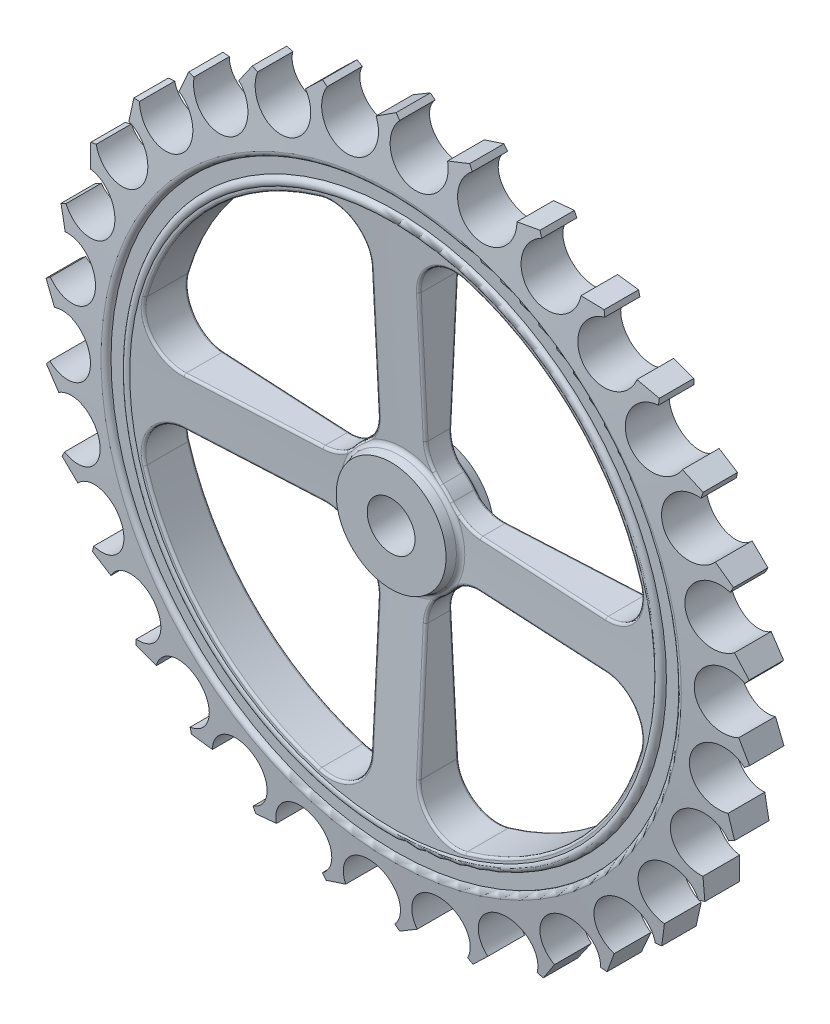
from build123d import *

# Parameters (mm, degrees)
CUT_EXTRUDE_1_DEPTH = 5
FILLET_1_R          = 0.5
SKETCH_5_OUTSIDE_W  = 191.882
SKETCH_5_OUTSIDE_H  = 191.882
CUT_EXTRUDE_2_DEPTH = 5


with BuildPart() as part:
    # Sketch 3 → Revolve 1 (revolve)
    with BuildSketch(Plane(origin=(0, 0, 0), x_dir=(0, 0, -1), z_dir=(1, 0, 0)), mode=Mode.PRIVATE) as revolve_1_sk:
        with BuildLine():
            Line((5, 5), (-5, 5))
            Line((-5, 5), (-5, 11.5))
            Line((-5, 11.5), (-3.289756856, 11.958258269))
            ThreePointArc((-3.289756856, 11.958258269), (-2.739558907, 12.336398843), (-2.549946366, 12.976520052))
            Line((-2.549946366, 12.976520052), (-4.75, 54.956044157))
            ThreePointArc((-4.75, 54.956044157), (-4.911437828, 56.028919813), (-4, 56.617481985))
            Line((-4, 56.617481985), (-4, 59.617481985))
            ThreePointArc((-4, 59.617481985), (-4.743144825, 59.948351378), (-4.994521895, 60.722010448))
            Line((-4.994521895, 60.722010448), (-3.6, 73.99))
            Line((-3.6, 73.99), (3.6, 73.99))
            Line((3.6, 73.99), (4.994521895, 60.722010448))
            ThreePointArc((4.994521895, 60.722010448), (4.743144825, 59.948351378), (4, 59.617481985))
            Line((4, 59.617481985), (4, 56.617481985))
            ThreePointArc((4, 56.617481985), (4.911437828, 56.028919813), (4.75, 54.956044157))
            Line((4.75, 54.956044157), (2.549946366, 12.976520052))
            ThreePointArc((2.549946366, 12.976520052), (2.739558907, 12.336398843), (3.289756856, 11.958258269))
            Line((3.289756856, 11.958258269), (5, 11.5))
            Line((5, 11.5), (5, 5))
        make_face()
    revolve(revolve_1_sk.sketch.rotate(Axis((0, 0, 28.336649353), (0, 0, -1)), 90), axis=Axis((0, 0, 28.336649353), (0, 0, -1)))

    # Sketch 4 → Cut-Extrude 1 (cut, symmetric)
    with BuildSketch(Plane.XY):
        with BuildLine():
            Line((5, 44.124822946), (5, 16.492422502))
            ThreePointArc((5, 16.492422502), (5.802116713, 13.000936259), (8.047619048, 10.209594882))
            ThreePointArc((8.047619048, 10.209594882), (9.192388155, 9.192388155), (10.209594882, 8.047619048))
            ThreePointArc((10.209594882, 8.047619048), (13.000936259, 5.802116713), (16.492422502, 5))
            Line((16.492422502, 5), (44.124822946, 5))
            ThreePointArc((44.124822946, 5), (50.531341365, 8.208703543), (51.798705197, 15.260869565))
            ThreePointArc((51.798705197, 15.260869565), (38.183766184, 38.183766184), (15.260869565, 51.798705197))
            ThreePointArc((15.260869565, 51.798705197), (8.208703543, 50.531341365), (5, 44.124822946))
        make_face()
        with BuildLine():
            Line((44.124822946, -5), (16.492422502, -5))
            ThreePointArc((16.492422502, -5), (13.000936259, -5.802116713), (10.209594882, -8.047619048))
            ThreePointArc((10.209594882, -8.047619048), (9.192388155, -9.192388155), (8.047619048, -10.209594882))
            ThreePointArc((8.047619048, -10.209594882), (5.802116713, -13.000936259), (5, -16.492422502))
            Line((5, -16.492422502), (5, -44.124822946))
            ThreePointArc((5, -44.124822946), (8.208703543, -50.531341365), (15.260869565, -51.798705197))
            ThreePointArc((15.260869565, -51.798705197), (38.183766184, -38.183766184), (51.798705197, -15.260869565))
            ThreePointArc((51.798705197, -15.260869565), (50.531341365, -8.208703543), (44.124822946, -5))
        make_face()
        with BuildLine():
            Line((-5, -44.124822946), (-5, -16.492422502))
            ThreePointArc((-5, -16.492422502), (-5.802116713, -13.000936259), (-8.047619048, -10.209594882))
            ThreePointArc((-8.047619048, -10.209594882), (-9.192388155, -9.192388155), (-10.209594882, -8.047619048))
            ThreePointArc((-10.209594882, -8.047619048), (-13.000936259, -5.802116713), (-16.492422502, -5))
            Line((-16.492422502, -5), (-44.124822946, -5))
            ThreePointArc((-44.124822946, -5), (-50.531341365, -8.208703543), (-51.798705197, -15.260869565))
            ThreePointArc((-51.798705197, -15.260869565), (-38.183766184, -38.183766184), (-15.260869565, -51.798705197))
            ThreePointArc((-15.260869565, -51.798705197), (-8.208703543, -50.531341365), (-5, -44.124822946))
        make_face()
        with BuildLine():
            Line((-44.124822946, 5), (-16.492422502, 5))
            ThreePointArc((-16.492422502, 5), (-13.000936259, 5.802116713), (-10.209594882, 8.047619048))
            ThreePointArc((-10.209594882, 8.047619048), (-9.192388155, 9.192388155), (-8.047619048, 10.209594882))
            ThreePointArc((-8.047619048, 10.209594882), (-5.802116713, 13.000936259), (-5, 16.492422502))
            Line((-5, 16.492422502), (-5, 44.124822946))
            ThreePointArc((-5, 44.124822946), (-8.208703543, 50.531341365), (-15.260869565, 51.798705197))
            ThreePointArc((-15.260869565, 51.798705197), (-38.183766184, 38.183766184), (-51.798705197, 15.260869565))
            ThreePointArc((-51.798705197, 15.260869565), (-50.531341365, 8.208703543), (-44.124822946, 5))
        make_face()
    extrude(amount=CUT_EXTRUDE_1_DEPTH, both=True, mode=Mode.SUBTRACT)

    # Fillet 1
    fillet_1_edges = [part.edges().sort_by_distance(p)[0] for p in [
        (50.529342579, -8.206032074, -4.552700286),
        (38.183766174, -38.183766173, -4.699895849),
        (8.206032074, -50.529342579, -4.552700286),
        (5, -30.308897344, -3.479766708),
        (5.801528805, -13.002148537, -2.616044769),
        (9.192388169, -9.192388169, -2.551176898),
        (13.002148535, -5.8015288, -2.616044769),
        (30.308897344, -5, -3.479766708),
        (-5, -30.308897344, 3.479766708),
        (-5.8015288, -13.002148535, 2.616044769),
        (-9.192388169, -9.192388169, 2.551176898),
        (-13.002148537, -5.801528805, 2.616044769),
        (-30.308897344, -5, 3.479766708),
        (-50.529342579, -8.206032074, 4.552700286),
        (-38.183766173, -38.183766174, 4.699895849),
        (-8.206032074, -50.529342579, 4.552700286),
        (-8.206032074, -50.529342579, -4.552700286),
        (-38.183766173, -38.183766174, -4.699895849),
        (-50.529342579, -8.206032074, -4.552700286),
        (-30.308897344, -5, -3.479766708),
        (-13.002148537, -5.801528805, -2.616044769),
        (-9.192388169, -9.192388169, -2.551176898),
        (-5.8015288, -13.002148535, -2.616044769),
        (-5, -30.308897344, -3.479766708),
        (-30.308897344, 5, 3.479766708),
        (-13.002148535, 5.8015288, 2.616044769),
        (-9.192388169, 9.192388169, 2.551176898),
        (-5.801528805, 13.002148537, 2.616044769),
        (-5, 30.308897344, 3.479766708),
        (-8.206032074, 50.529342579, 4.552700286),
        (-38.183766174, 38.183766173, 4.699895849),
        (-50.529342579, 8.206032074, 4.552700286),
        (-50.529342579, 8.206032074, -4.552700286),
        (-38.183766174, 38.183766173, -4.699895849),
        (-8.206032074, 50.529342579, -4.552700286),
        (-5, 30.308897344, -3.479766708),
        (-5.801528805, 13.002148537, -2.616044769),
        (-9.192388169, 9.192388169, -2.551176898),
        (-13.002148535, 5.8015288, -2.616044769),
        (-30.308897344, 5, -3.479766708),
        (5, 30.308897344, 3.479766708),
        (5.8015288, 13.002148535, 2.616044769),
        (9.192388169, 9.192388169, 2.551176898),
        (13.002148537, 5.801528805, 2.616044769),
        (30.308897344, 5, 3.479766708),
        (50.529342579, 8.206032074, 4.552700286),
        (38.183766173, 38.183766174, 4.699895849),
        (8.206032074, 50.529342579, 4.552700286),
        (8.206032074, 50.529342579, -4.552700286),
        (38.183766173, 38.183766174, -4.699895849),
        (50.529342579, 8.206032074, -4.552700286),
        (30.308897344, 5, -3.479766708),
        (13.002148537, 5.801528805, -2.616044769),
        (9.192388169, 9.192388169, -2.551176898),
        (5.8015288, 13.002148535, -2.616044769),
        (5, 30.308897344, -3.479766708),
        (30.308897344, -5, 3.479766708),
        (13.002148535, -5.8015288, 2.616044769),
        (9.192388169, -9.192388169, 2.551176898),
        (5.801528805, -13.002148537, 2.616044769),
        (5, -30.308897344, 3.479766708),
        (8.206032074, -50.529342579, 4.552700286),
        (38.183766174, -38.183766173, 4.699895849),
        (50.529342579, -8.206032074, 4.552700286),
    ]]
    fillet(fillet_1_edges, radius=FILLET_1_R)

    # Sketch 5 outside → Cut-Extrude 2 (cut, symmetric)
    with BuildSketch(Plane.XY):
        Rectangle(SKETCH_5_OUTSIDE_W, SKETCH_5_OUTSIDE_H)
        with BuildLine():
            Line((-19.085723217, 69.080352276), (-15.744825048, 72.29537042))
            Line((-15.744825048, 72.29537042), (-14.694285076, 71.584101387))
            ThreePointArc((-14.694285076, 71.584101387), (-9.539316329, 62.558169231), (-4.306041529, 71.538925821))
            Line((-4.306041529, 71.538925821), (-0.369710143, 73.989076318))
            Line((-0.369710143, 73.989076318), (0.509991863, 73.074930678))
            ThreePointArc((0.509991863, 73.074930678), (3.675715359, 63.174458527), (10.661834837, 70.870905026))
            Line((10.661834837, 70.870905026), (15.02156287, 72.449104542))
            Line((15.02156287, 72.449104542), (15.691979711, 71.372034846))
            ThreePointArc((15.691979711, 71.372034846), (16.730100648, 61.029720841), (25.163737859, 67.105485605))
            Line((25.163737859, 67.105485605), (29.756321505, 67.742759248))
            Line((29.756321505, 67.742759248), (30.188152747, 66.54983861))
            ThreePointArc((30.188152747, 66.54983861), (29.053300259, 56.2176915), (38.565864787, 60.407234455))
            Line((38.565864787, 60.407234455), (43.190586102, 60.075730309))
            Line((43.190586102, 60.075730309), (43.364958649, 58.819095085))
            ThreePointArc((43.364958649, 58.819095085), (40.106731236, 48.948679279), (50.282478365, 51.068897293))
            Line((50.282478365, 51.068897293), (54.737214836, 49.78310368))
            Line((54.737214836, 49.78310368), (54.64650777, 48.51767486))
            ThreePointArc((54.64650777, 48.51767486), (49.407305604, 39.540374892), (59.801506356, 39.498604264))
            Line((59.801506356, 39.498604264), (63.891564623, 37.314716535))
            Line((63.891564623, 37.314716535), (63.539742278, 36.09579943))
            ThreePointArc((63.539742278, 36.09579943), (56.548543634, 28.403966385), (66.70692156, 26.202032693))
            Line((66.70692156, 26.202032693), (70.25354645, 23.215497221))
            Line((70.25354645, 23.215497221), (69.655985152, 22.096364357))
            ThreePointArc((69.655985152, 22.096364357), (61.218338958, 16.026168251), (70.696924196, 11.760306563))
            Line((70.696924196, 11.760306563), (73.545111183, 8.101649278))
            Line((73.545111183, 8.101649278), (72.727927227, 7.131212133))
            ThreePointArc((72.727927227, 7.131212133), (63.212599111, 2.947949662), (71.597132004, -3.195401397))
            Line((71.597132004, -3.195401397), (73.62240165, -7.366279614))
            Line((73.62240165, -7.366279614), (72.621309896, -8.145608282))
            ThreePointArc((72.621309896, -8.145608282), (62.444165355, -10.259108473), (69.368201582, -18.011454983))
            Line((69.368201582, -18.011454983), (70.482039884, -22.51226674))
            Line((70.482039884, -22.51226674), (69.340792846, -23.066426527))
            ThreePointArc((69.340792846, -23.066426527), (58.946621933, -23.01779434), (64.107547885, -32.040321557))
            Line((64.107547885, -32.040321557), (64.261274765, -36.674359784))
            Line((64.261274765, -36.674359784), (63.029750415, -36.979131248))
            ThreePointArc((63.029750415, -36.979131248), (52.872828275, -34.770492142), (56.045086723, -44.668872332))
            Line((56.045086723, -44.668872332), (55.23198358, -49.233607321))
            Line((55.23198358, -49.233607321), (53.964005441, -49.275670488))
            ThreePointArc((53.964005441, -49.275670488), (44.48823831, -45.00355259), (45.533186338, -55.345179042))
            Line((45.533186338, -55.345179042), (43.788789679, -59.64110997))
            Line((43.788789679, -59.64110997), (42.53977448, -59.418626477))
            ThreePointArc((42.53977448, -59.418626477), (34.159298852, -53.269741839), (33.031267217, -63.602635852))
            Line((33.031267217, -63.602635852), (30.431815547, -67.442009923))
            Line((30.431815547, -67.442009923), (29.256351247, -66.964703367))
            ThreePointArc((29.256351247, -66.964703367), (22.33743412, -59.207787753), (19.085723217, -69.080352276))
            Line((19.085723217, -69.080352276), (15.744825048, -72.29537042))
            Line((15.744825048, -72.29537042), (14.694285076, -71.584101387))
            ThreePointArc((14.694285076, -71.584101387), (9.539316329, -62.558169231), (4.306041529, -71.538925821))
            Line((4.306041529, -71.538925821), (0.369710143, -73.989076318))
            Line((0.369710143, -73.989076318), (-0.509991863, -73.074930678))
            ThreePointArc((-0.509991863, -73.074930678), (-3.675715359, -63.174458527), (-10.661834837, -70.870905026))
            Line((-10.661834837, -70.870905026), (-15.02156287, -72.449104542))
            Line((-15.02156287, -72.449104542), (-15.691979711, -71.372034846))
            ThreePointArc((-15.691979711, -71.372034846), (-16.730100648, -61.029720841), (-25.163737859, -67.105485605))
            Line((-25.163737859, -67.105485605), (-29.756321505, -67.742759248))
            Line((-29.756321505, -67.742759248), (-30.188152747, -66.54983861))
            ThreePointArc((-30.188152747, -66.54983861), (-29.053300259, -56.2176915), (-38.565864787, -60.407234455))
            Line((-38.565864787, -60.407234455), (-43.190586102, -60.075730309))
            Line((-43.190586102, -60.075730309), (-43.364958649, -58.819095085))
            ThreePointArc((-43.364958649, -58.819095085), (-40.106731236, -48.948679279), (-50.282478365, -51.068897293))
            Line((-50.282478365, -51.068897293), (-54.737214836, -49.78310368))
            Line((-54.737214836, -49.78310368), (-54.64650777, -48.51767486))
            ThreePointArc((-54.64650777, -48.51767486), (-49.407305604, -39.540374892), (-59.801506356, -39.498604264))
            Line((-59.801506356, -39.498604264), (-63.891564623, -37.314716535))
            Line((-63.891564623, -37.314716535), (-63.539742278, -36.09579943))
            ThreePointArc((-63.539742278, -36.09579943), (-56.548543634, -28.403966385), (-66.70692156, -26.202032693))
            Line((-66.70692156, -26.202032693), (-70.25354645, -23.215497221))
            Line((-70.25354645, -23.215497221), (-69.655985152, -22.096364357))
            ThreePointArc((-69.655985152, -22.096364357), (-61.218338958, -16.026168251), (-70.696924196, -11.760306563))
            Line((-70.696924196, -11.760306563), (-73.545111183, -8.101649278))
            Line((-73.545111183, -8.101649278), (-72.727927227, -7.131212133))
            ThreePointArc((-72.727927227, -7.131212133), (-63.212599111, -2.947949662), (-71.597132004, 3.195401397))
            Line((-71.597132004, 3.195401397), (-73.62240165, 7.366279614))
            Line((-73.62240165, 7.366279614), (-72.621309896, 8.145608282))
            ThreePointArc((-72.621309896, 8.145608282), (-62.444165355, 10.259108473), (-69.368201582, 18.011454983))
            Line((-69.368201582, 18.011454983), (-70.482039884, 22.51226674))
            Line((-70.482039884, 22.51226674), (-69.340792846, 23.066426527))
            ThreePointArc((-69.340792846, 23.066426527), (-58.946621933, 23.01779434), (-64.107547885, 32.040321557))
            Line((-64.107547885, 32.040321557), (-64.261274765, 36.674359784))
            Line((-64.261274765, 36.674359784), (-63.029750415, 36.979131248))
            ThreePointArc((-63.029750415, 36.979131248), (-52.872828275, 34.770492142), (-56.045086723, 44.668872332))
            Line((-56.045086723, 44.668872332), (-55.23198358, 49.233607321))
            Line((-55.23198358, 49.233607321), (-53.964005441, 49.275670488))
            ThreePointArc((-53.964005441, 49.275670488), (-44.48823831, 45.00355259), (-45.533186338, 55.345179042))
            Line((-45.533186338, 55.345179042), (-43.788789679, 59.64110997))
            Line((-43.788789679, 59.64110997), (-42.53977448, 59.418626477))
            ThreePointArc((-42.53977448, 59.418626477), (-34.159298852, 53.269741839), (-33.031267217, 63.602635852))
            Line((-33.031267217, 63.602635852), (-30.431815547, 67.442009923))
            Line((-30.431815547, 67.442009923), (-29.256351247, 66.964703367))
            ThreePointArc((-29.256351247, 66.964703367), (-22.33743412, 59.207787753), (-19.085723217, 69.080352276))
        make_face(mode=Mode.SUBTRACT)
    extrude(amount=CUT_EXTRUDE_2_DEPTH, both=True, mode=Mode.SUBTRACT)


solid = part.part
